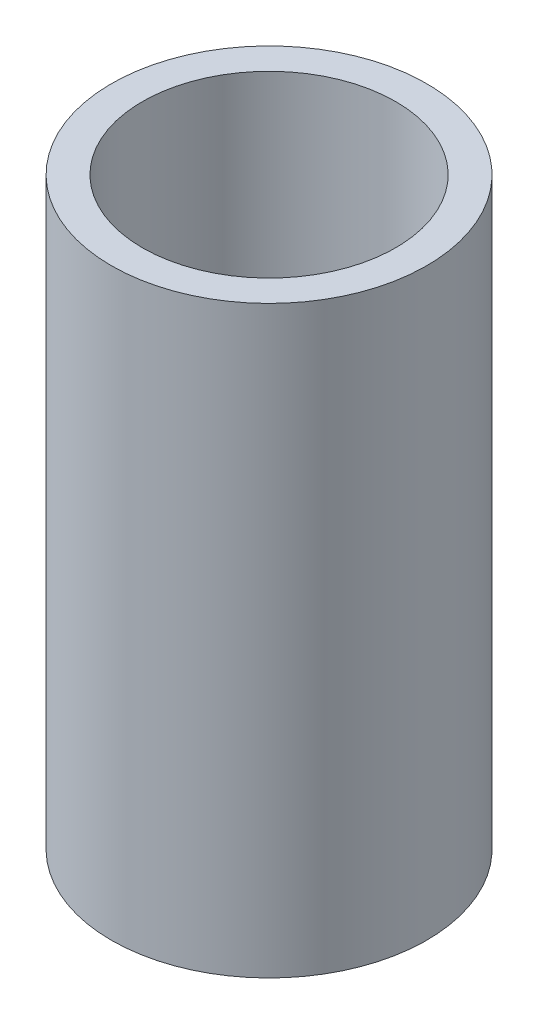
ISO-10303-21;
HEADER;
FILE_DESCRIPTION(('STEP AP214'),'2;1');
FILE_NAME('part.step','',(''),(''),'','','');
FILE_SCHEMA(('AUTOMOTIVE_DESIGN { 1 0 10303 214 1 1 1 1 }'));
ENDSEC;
DATA;
#1=APPLICATION_CONTEXT('core data for automotive mechanical design processes');
#2=APPLICATION_PROTOCOL_DEFINITION('international standard','automotive_design',2000,#1);
#3=PRODUCT_CONTEXT('',#1,'mechanical');
#4=PRODUCT('Part','Part','',(#3));
#5=PRODUCT_RELATED_PRODUCT_CATEGORY('part','',(#4));
#6=PRODUCT_DEFINITION_FORMATION('','',#4);
#7=PRODUCT_DEFINITION_CONTEXT('part definition',#1,'design');
#8=PRODUCT_DEFINITION('design','',#6,#7);
#9=PRODUCT_DEFINITION_SHAPE('','',#8);
#10=(LENGTH_UNIT() NAMED_UNIT(*) SI_UNIT(.MILLI.,.METRE.));
#11=(NAMED_UNIT(*) PLANE_ANGLE_UNIT() SI_UNIT($,.RADIAN.));
#12=(NAMED_UNIT(*) SI_UNIT($,.STERADIAN.) SOLID_ANGLE_UNIT());
#13=UNCERTAINTY_MEASURE_WITH_UNIT(LENGTH_MEASURE(1.E-05),#10,'distance_accuracy_value','');
#14=(GEOMETRIC_REPRESENTATION_CONTEXT(3) GLOBAL_UNCERTAINTY_ASSIGNED_CONTEXT((#13)) GLOBAL_UNIT_ASSIGNED_CONTEXT((#10,
#11,#12)) REPRESENTATION_CONTEXT('',''));
#15=CARTESIAN_POINT('',(0.,0.,0.));
#16=DIRECTION('',(0.,0.,1.));
#17=DIRECTION('',(1.,0.,0.));
#18=AXIS2_PLACEMENT_3D('',#15,#16,#17);
#19=CARTESIAN_POINT('',(0.,56.5,0.));
#20=DIRECTION('',(0.,1.,0.));
#21=DIRECTION('',(0.,0.,1.));
#22=AXIS2_PLACEMENT_3D('',#19,#20,#21);
#23=PLANE('',#22);
#24=CARTESIAN_POINT('',(0.,56.5,0.));
#25=DIRECTION('',(0.,1.,0.));
#26=DIRECTION('',(0.,0.,1.));
#27=AXIS2_PLACEMENT_3D('',#24,#25,#26);
#28=CIRCLE('',#27,15.25);
#29=CARTESIAN_POINT('',(0.,56.5,15.25));
#30=VERTEX_POINT('',#29);
#31=EDGE_CURVE('E10',#30,#30,#28,.T.);
#32=ORIENTED_EDGE('',*,*,#31,.T.);
#33=EDGE_LOOP('',(#32));
#34=FACE_BOUND('',#33,.T.);
#35=CARTESIAN_POINT('',(0.,56.5,0.));
#36=DIRECTION('',(0.,1.,0.));
#37=DIRECTION('',(0.,0.,1.));
#38=AXIS2_PLACEMENT_3D('',#35,#36,#37);
#39=CIRCLE('',#38,12.25);
#40=CARTESIAN_POINT('',(0.,56.5,12.25));
#41=VERTEX_POINT('',#40);
#42=EDGE_CURVE('E26',#41,#41,#39,.T.);
#43=ORIENTED_EDGE('',*,*,#42,.F.);
#44=EDGE_LOOP('',(#43));
#45=FACE_BOUND('',#44,.T.);
#46=ADVANCED_FACE('F15',(#34,#45),#23,.T.);
#47=CARTESIAN_POINT('',(0.,0.,0.));
#48=DIRECTION('',(0.,1.,0.));
#49=DIRECTION('',(0.,0.,1.));
#50=AXIS2_PLACEMENT_3D('',#47,#48,#49);
#51=PLANE('',#50);
#52=CARTESIAN_POINT('',(0.,0.,0.));
#53=DIRECTION('',(0.,1.,0.));
#54=DIRECTION('',(0.,0.,1.));
#55=AXIS2_PLACEMENT_3D('',#52,#53,#54);
#56=CIRCLE('',#55,15.25);
#57=CARTESIAN_POINT('',(0.,0.,15.25));
#58=VERTEX_POINT('',#57);
#59=EDGE_CURVE('E22',#58,#58,#56,.T.);
#60=ORIENTED_EDGE('',*,*,#59,.F.);
#61=EDGE_LOOP('',(#60));
#62=FACE_BOUND('',#61,.T.);
#63=CARTESIAN_POINT('',(0.,0.,0.));
#64=DIRECTION('',(0.,1.,0.));
#65=DIRECTION('',(0.,0.,1.));
#66=AXIS2_PLACEMENT_3D('',#63,#64,#65);
#67=CIRCLE('',#66,12.25);
#68=CARTESIAN_POINT('',(0.,0.,12.25));
#69=VERTEX_POINT('',#68);
#70=EDGE_CURVE('E30',#69,#69,#67,.T.);
#71=ORIENTED_EDGE('',*,*,#70,.T.);
#72=EDGE_LOOP('',(#71));
#73=FACE_BOUND('',#72,.T.);
#74=ADVANCED_FACE('F36',(#62,#73),#51,.F.);
#75=CARTESIAN_POINT('',(0.,56.5,0.));
#76=DIRECTION('',(0.,-1.,0.));
#77=DIRECTION('',(0.,0.,-1.));
#78=AXIS2_PLACEMENT_3D('',#75,#76,#77);
#79=CYLINDRICAL_SURFACE('',#78,15.25);
#80=ORIENTED_EDGE('',*,*,#31,.F.);
#81=EDGE_LOOP('',(#80));
#82=FACE_BOUND('',#81,.T.);
#83=ORIENTED_EDGE('',*,*,#59,.T.);
#84=EDGE_LOOP('',(#83));
#85=FACE_BOUND('',#84,.T.);
#86=ADVANCED_FACE('F17',(#82,#85),#79,.T.);
#87=CARTESIAN_POINT('',(0.,56.5,0.));
#88=DIRECTION('',(0.,-1.,0.));
#89=DIRECTION('',(0.,0.,-1.));
#90=AXIS2_PLACEMENT_3D('',#87,#88,#89);
#91=CYLINDRICAL_SURFACE('',#90,12.25);
#92=ORIENTED_EDGE('',*,*,#42,.T.);
#93=EDGE_LOOP('',(#92));
#94=FACE_BOUND('',#93,.T.);
#95=ORIENTED_EDGE('',*,*,#70,.F.);
#96=EDGE_LOOP('',(#95));
#97=FACE_BOUND('',#96,.T.);
#98=ADVANCED_FACE('F38',(#94,#97),#91,.F.);
#99=CLOSED_SHELL('',(#46,#74,#86,#98));
#100=MANIFOLD_SOLID_BREP('B1',#99);
#101=ADVANCED_BREP_SHAPE_REPRESENTATION('',(#18,#100),#14);
#102=SHAPE_DEFINITION_REPRESENTATION(#9,#101);
ENDSEC;
END-ISO-10303-21;
